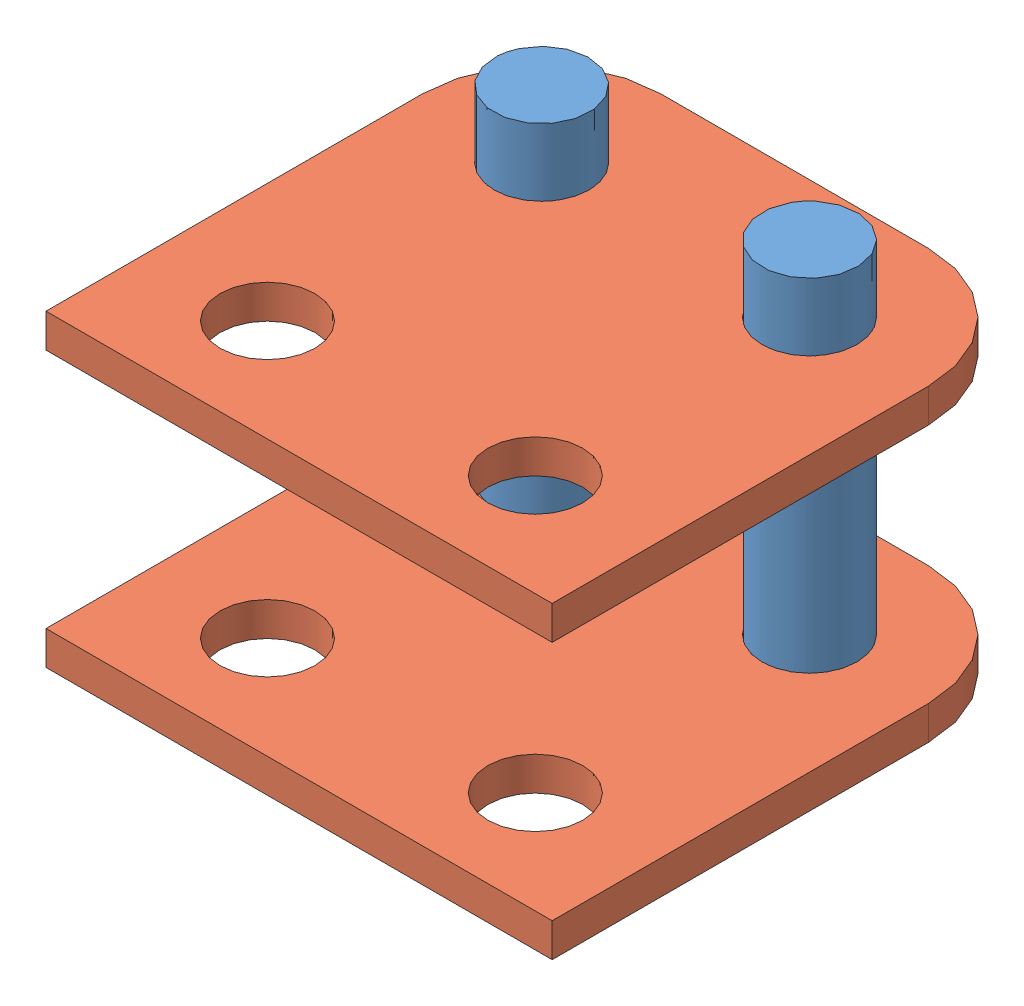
SolidWorks assembly Aussenglied_8.SLDASM, configuration Standard (file format 3400). Lengths in mm.
Overall size (24 21 23.5).
4 component instances, 2 part files, 11 mates.
Components (placement in the parent):
- Bolzen-1: Bolzen.SLDPRT [Standard] at (12.7 21 0) x (-0.767613 0 -0.640914) z (0 -1 0) size (4.5 4.5 21)
- Flachlasche-3: Flachlasche.SLDPRT [Standard] at (-5.65 17.815 -5.65) x (1 0 0) z (0 -1 0) size (24 23.5 1.6)
- Flachlasche-4: Flachlasche.SLDPRT [Standard] at (18.35 3.185 -5.65) x (-1 0 0) z (0 1 0) size (24 23.5 1.6)
- Bolzen-4: Bolzen.SLDPRT [Standard] at (0 21 0) x (-0.968002 0 -0.250944) z (0 -1 0) size (4.5 4.5 21)
Mates (geometry in assembly coordinates):
- Konzentrisch8: concentric aligned: cylinder of Bolzen-1; cylinder of Flachlasche-4
- Konzentrisch9: concentric anti-aligned: cylinder of Bolzen-1; cylinder of Flachlasche-3
- Abstand3: distance = 11.43 mm: line of Flachlasche-3; line of Flachlasche-4
- Abstand5: distance = 3.185 mm aligned: plane of Bolzen-1 through (12.7 0 0) normal (0 -1 0); plane of Flachlasche-4 through (12.7 3.185 0) normal (0 -1 0)
- Konzentrisch12: concentric anti-aligned: cylinder of Flachlasche-3; cylinder of Bolzen-4
- Konzentrisch13: concentric aligned: cylinder of Flachlasche-4; cylinder of Bolzen-4
- Abstand11: distance = 3.185 mm aligned: plane of Flachlasche-4 through (12.7 3.185 0) normal (0 -1 0); plane of Bolzen-4 through (0 0 0) normal (0 -1 0)
- Deckungsgleich4: coincident: point of Bolzen-4
- Senkrecht3: perpendicular: unknown of Flachlasche-4
- Mittel-EBENE: unknown = 5.715 mm: unknown of ?
- Achse2: unknown: unknown of Bolzen-1
